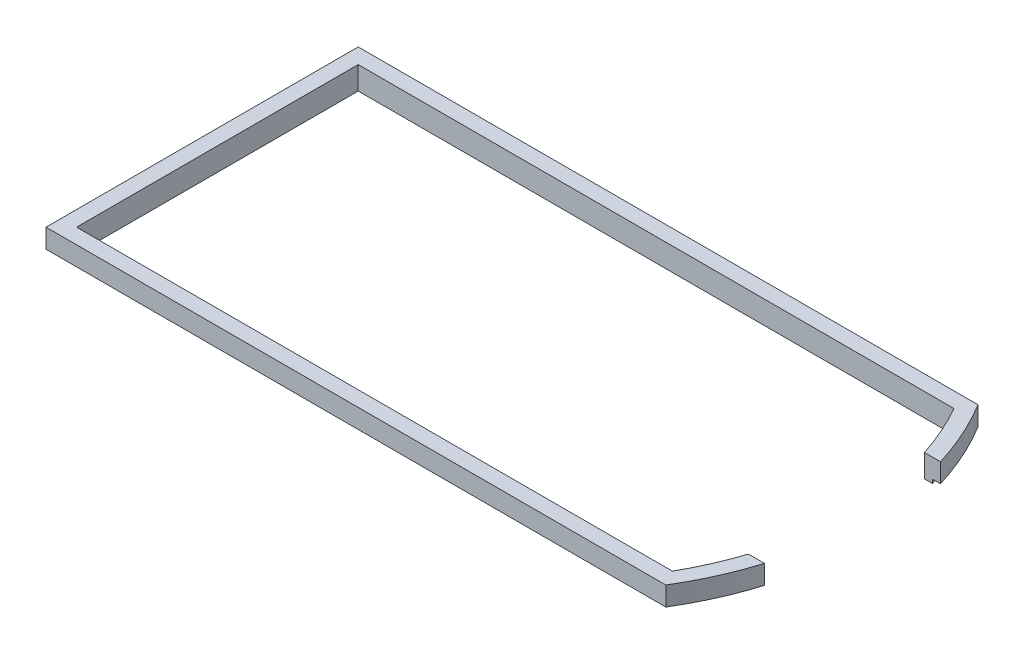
from build123d import *

# Parameters (mm, degrees)
EXTRUSION2_DEPTH = 2.5
EXTRUSION3_DEPTH = 0.5


with BuildPart() as part:
    # Esquisse7 → Extrusion2 (new body)
    with BuildSketch(Plane(origin=(0, 0, 0), x_dir=(1, 0, 0), z_dir=(0, 1, 0))):
        with BuildLine():
            Line((80.995281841, 0), (0, 0))
            Line((0, 0), (0, 40.8))
            Line((0, 40.8), (80.995281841, 40.8))
            ThreePointArc((80.995281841, 40.8), (83.273401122, 36.474925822), (84.995651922, 31.9))
            Line((84.995651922, 31.9), (82.898332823, 31.9))
            ThreePointArc((82.898332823, 31.9), (81.55059363, 35.427377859), (79.852295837, 38.8))
            Line((79.852295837, 38.8), (2, 38.8))
            Line((2, 38.8), (2, 20.4))
            Line((2, 20.4), (2, 2))
            Line((2, 2), (79.852295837, 2))
            ThreePointArc((79.852295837, 2), (81.55059363, 5.372622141), (82.898332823, 8.9))
            Line((82.898332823, 8.9), (84.995651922, 8.9))
            ThreePointArc((84.995651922, 8.9), (83.273401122, 4.325074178), (80.995281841, 0))
        make_face()
    extrude(amount=-EXTRUSION2_DEPTH)

    # Esquisse9 → Extrusion3 (add)
    with BuildSketch(Plane.XZ.offset(2.5)):
        with BuildLine():
            Line((79.852295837, -2), (2, -2))
            Line((2, -2), (2, -38.8))
            Line((2, -38.8), (79.852295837, -38.8))
            ThreePointArc((79.852295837, -38.8), (81.55059363, -35.427377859), (82.898332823, -31.9))
            Line((82.898332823, -31.9), (83.948360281, -31.9))
            ThreePointArc((83.948360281, -31.9), (82.412789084, -35.949900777), (80.428749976, -39.8))
            Line((80.428749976, -39.8), (1, -39.8))
            Line((1, -39.8), (1, -1))
            Line((1, -1), (80.428749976, -1))
            ThreePointArc((80.428749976, -1), (82.412789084, -4.850099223), (83.948360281, -8.9))
            Line((83.948360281, -8.9), (82.898332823, -8.9))
            ThreePointArc((82.898332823, -8.9), (81.55059363, -5.372622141), (79.852295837, -2))
        make_face()
    extrude(amount=EXTRUSION3_DEPTH)


solid = part.part
